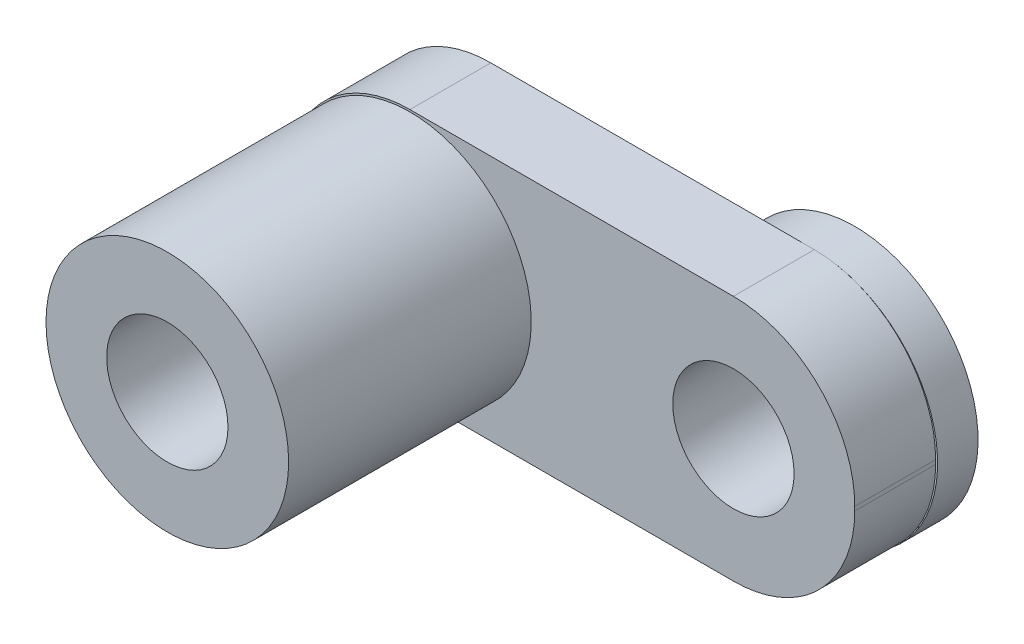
from build123d import *

# Parameters (mm, degrees)
EXTRUSION1_DEPTH             = 2
ESQUISSE2_R                  = 3
EXTRUSION2_DEPTH             = 6
ESQUISSE3_R                  = 3.05
EXTRUSION3_DEPTH             = 1
ENL_V_MAT_EXTRU_1_DEPTH      = 17.450303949
ENL_V_MAT_EXTRU_1_DEPTH_BACK = 17.450303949
ESQUISSE4_R                  = 1.5


with BuildPart() as part:
    # Esquisse1 → Extrusion1 (new body)
    with BuildSketch(Plane.XY):
        with BuildLine():
            Line((3, 0), (11, 0))
            ThreePointArc((11, 0), (13.121320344, 0.878679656), (14, 3))
            Line((14, 3), (14, 3.1))
            ThreePointArc((14, 3.1), (13.121320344, 5.221320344), (11, 6.1))
            Line((11, 6.1), (3, 6.1))
            ThreePointArc((3, 6.1), (0.878679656, 5.221320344), (0, 3.1))
            Line((0, 3.1), (0, 3))
            ThreePointArc((0, 3), (0.878679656, 0.878679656), (3, 0))
        make_face()
    extrude(amount=EXTRUSION1_DEPTH)

    # Esquisse2 → Extrusion2 (add)
    with BuildSketch(Plane.XY.offset(2)):
        with Locations(Location((3, 3.05, 0), (0, 0, 180))):
            Circle(ESQUISSE2_R)
    extrude(amount=EXTRUSION2_DEPTH)

    # Esquisse3 → Extrusion3 (add)
    with BuildSketch(Plane(origin=(0, 0, 0), x_dir=(-1, 0, 0), z_dir=(0, 0, -1))):
        with Locations(Location((-11, 3.05, 0), (0, 0, 270))):
            Circle(ESQUISSE3_R)
    extrude(amount=EXTRUSION3_DEPTH)

    # Esquisse4 → Enl_v. mat.-Extru.1 (cut, two sides: drawn at the far end of the back side and taken through both)
    with BuildSketch(Plane.XY.offset(2).offset(-ENL_V_MAT_EXTRU_1_DEPTH_BACK)):
        with Locations((3, 3.05)):
            Circle(ESQUISSE4_R)
        with Locations((11, 3.05)):
            Circle(ESQUISSE4_R)
    extrude(amount=ENL_V_MAT_EXTRU_1_DEPTH + ENL_V_MAT_EXTRU_1_DEPTH_BACK, mode=Mode.SUBTRACT)


solid = part.part
